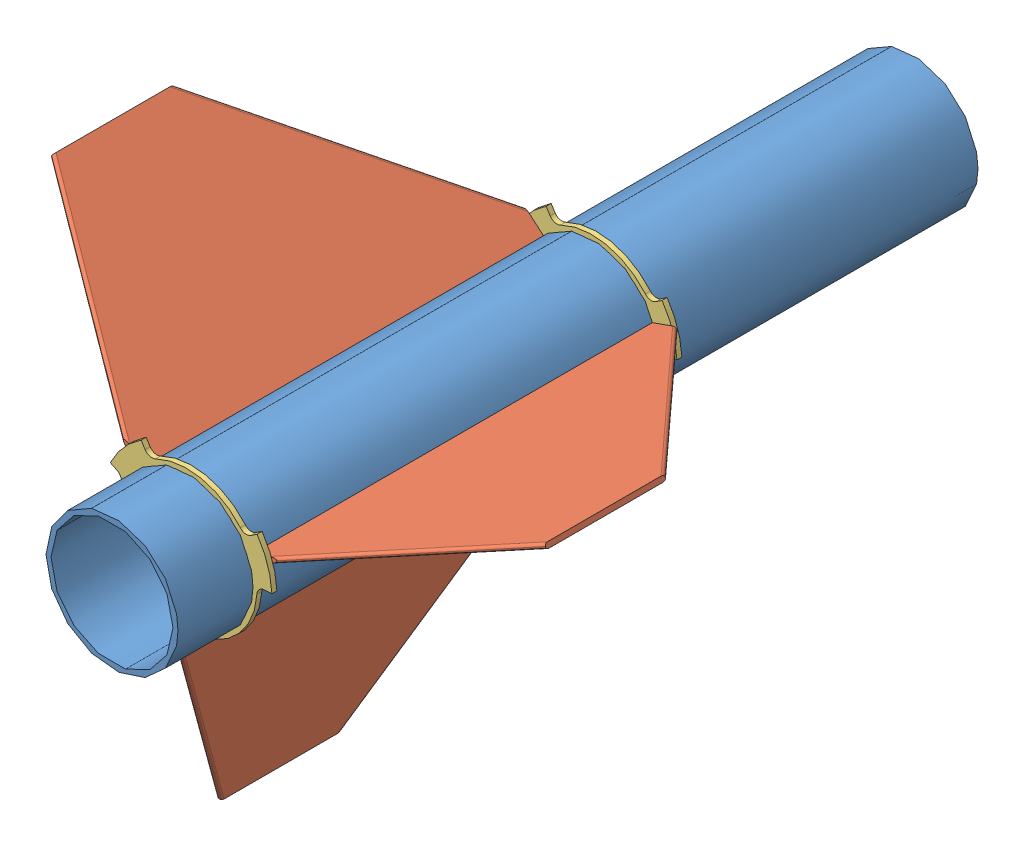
SolidWorks assembly MMT and Fin assembly.SLDASM, configuration Default (file format 3100). Lengths in mm.
Overall size (157.54 151.1 254).
6 component instances, 3 part files, 14 mates.
Components (placement in the parent):
- Motor Mount Tube-1: Motor Mount Tube.SLDPRT [Default] at (-23.0842 -0.7711 -114.2949) size (41.91 41.91 254)
- Fin-1: Fin.SLDPRT [Default] at (-44.2682 18.3998 44.2916) x (0 0 1) z (-0.650139 -0.759815 0) size (127 71.44 1.59)
- Fin-2: Fin.SLDPRT [Default] at (-29.0946 -28.7025 44.2916) x (0 0 1) z (0.983089 -0.18313 0) size (127 71.44 1.59)
- Fin-3: Fin.SLDPRT [Default] at (4.1104 7.9894 44.2916) x (0 0 1) z (-0.332949 0.942945 0) size (127 71.44 1.59)
- Minimal Centering Ring-1: Minimal Centering Ring.SLDPRT [Default] at (-23.0842 -0.7711 -14.2824) x (0.662098 0.749417 0) z (0 0 1) size (52.35 49.21 1.59)
- Minimal Centering Ring-2: Minimal Centering Ring.SLDPRT [Default] at (-23.0842 -0.7711 114.3051) x (0.662098 0.749417 0) z (0 0 1) size (52.35 49.21 1.59)
Mates (geometry in assembly coordinates):
- Concentric1: concentric: cylinder of Motor Mount Tube-1; cylinder of Fin-2
- Concentric2: concentric anti-aligned: cylinder of Motor Mount Tube-1; cylinder of Fin-1
- Concentric3: concentric anti-aligned: cylinder of Motor Mount Tube-1; cylinder of Fin-3
- Distance1: distance = 25.4 mm aligned: plane of Motor Mount Tube-1 through (-23.0842 -0.7711 139.7051) normal (0 0 1); plane of Fin-2 through (-27.534 -28.9932 114.3051) normal (0 0 1)
- Coincident2: coincident aligned: plane of Fin-1 through (-45.3003 17.1936 114.3051) normal (0 0 1); plane of Fin-3 through (3.5818 9.4863 114.3051) normal (0 0 1)
- Coincident3: coincident aligned: plane of Fin-2 through (-27.534 -28.9932 114.3051) normal (0 0 1); plane of Fin-3 through (3.5818 9.4863 114.3051) normal (0 0 1)
- Angle1: planar angle = 1.047198 rad aligned: plane of Fin-1 through (-37.031 12.2072 -12.6949) normal (0.650139 0.759815 0); plane of Fin-3 through (-4.8712 4.818 -12.6949) normal (0.332949 -0.942945 0)
- Angle2: planar angle = 5.235988 rad aligned: plane of Fin-1 through (-37.031 12.2072 -12.6949) normal (0.650139 0.759815 0); plane of Fin-2 through (-27.3503 -19.3386 -12.6949) normal (-0.983089 0.18313 0)
- Concentric4: concentric anti-aligned: cylinder of Motor Mount Tube-1; circle of Minimal Centering Ring-2 centre (-23.0842 -0.7711 115.8926) axis (0 0 1)
- Concentric5: concentric aligned: cylinder of Motor Mount Tube-1; circle of Minimal Centering Ring-1 centre (-23.0842 -0.7711 -25.3949) axis (0 0 -1)
- Coincident4: coincident aligned: plane of Minimal Centering Ring-1 through (20.0469 1.2116 -25.3949) normal (0.04592 -0.998945 0); plane of Minimal Centering Ring-2 through (20.0469 1.2116 115.8926) normal (0.04592 -0.998945 0)
- Angle3: planar angle = 6.021386 rad aligned: plane of Fin-3; plane of Minimal Centering Ring-2
- Coincident8: coincident anti-aligned: plane of Fin-1; plane of Minimal Centering Ring-2
- Coincident9: coincident anti-aligned: plane of Fin-1; plane of Minimal Centering Ring-1
